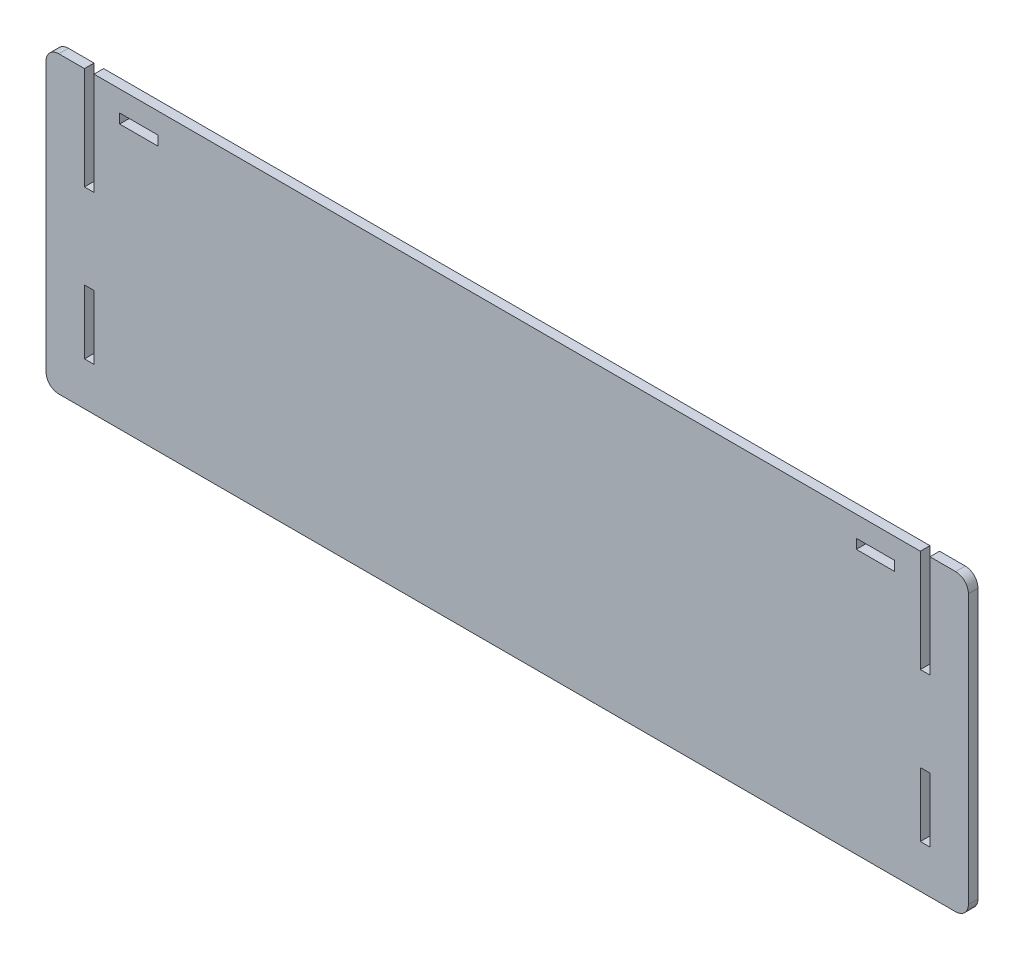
ISO-10303-21;
HEADER;
FILE_DESCRIPTION(('STEP AP214'),'2;1');
FILE_NAME('part.step','',(''),(''),'','','');
FILE_SCHEMA(('AUTOMOTIVE_DESIGN { 1 0 10303 214 1 1 1 1 }'));
ENDSEC;
DATA;
#1=APPLICATION_CONTEXT('core data for automotive mechanical design processes');
#2=APPLICATION_PROTOCOL_DEFINITION('international standard','automotive_design',2000,#1);
#3=PRODUCT_CONTEXT('',#1,'mechanical');
#4=PRODUCT('Part','Part','',(#3));
#5=PRODUCT_RELATED_PRODUCT_CATEGORY('part','',(#4));
#6=PRODUCT_DEFINITION_FORMATION('','',#4);
#7=PRODUCT_DEFINITION_CONTEXT('part definition',#1,'design');
#8=PRODUCT_DEFINITION('design','',#6,#7);
#9=PRODUCT_DEFINITION_SHAPE('','',#8);
#10=(LENGTH_UNIT() NAMED_UNIT(*) SI_UNIT(.MILLI.,.METRE.));
#11=(NAMED_UNIT(*) PLANE_ANGLE_UNIT() SI_UNIT($,.RADIAN.));
#12=(NAMED_UNIT(*) SI_UNIT($,.STERADIAN.) SOLID_ANGLE_UNIT());
#13=UNCERTAINTY_MEASURE_WITH_UNIT(LENGTH_MEASURE(1.E-05),#10,'distance_accuracy_value','');
#14=(GEOMETRIC_REPRESENTATION_CONTEXT(3) GLOBAL_UNCERTAINTY_ASSIGNED_CONTEXT((#13)) GLOBAL_UNIT_ASSIGNED_CONTEXT((#10,
#11,#12)) REPRESENTATION_CONTEXT('',''));
#15=CARTESIAN_POINT('',(0.,0.,0.));
#16=DIRECTION('',(0.,0.,1.));
#17=DIRECTION('',(1.,0.,0.));
#18=AXIS2_PLACEMENT_3D('',#15,#16,#17);
#19=CARTESIAN_POINT('',(0.,0.,19.05));
#20=DIRECTION('',(0.,0.,1.));
#21=DIRECTION('',(1.,0.,0.));
#22=AXIS2_PLACEMENT_3D('',#19,#20,#21);
#23=PLANE('',#22);
#24=DIRECTION('',(1.,0.,0.));
#25=VECTOR('',#24,1.);
#26=CARTESIAN_POINT('',(-838.2,-206.375,19.05));
#27=LINE('',#26,#25);
#28=CARTESIAN_POINT('',(-838.2,-206.375,19.05));
#29=VERTEX_POINT('',#28);
#30=CARTESIAN_POINT('',(-819.15,-206.375,19.05));
#31=VERTEX_POINT('',#30);
#32=EDGE_CURVE('E316',#29,#31,#27,.T.);
#33=ORIENTED_EDGE('',*,*,#32,.F.);
#34=DIRECTION('',(0.,-1.,0.));
#35=VECTOR('',#34,1.);
#36=CARTESIAN_POINT('',(-838.2,-79.3749999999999,19.05));
#37=LINE('',#36,#35);
#38=CARTESIAN_POINT('',(-838.2,-79.3749999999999,19.05));
#39=VERTEX_POINT('',#38);
#40=EDGE_CURVE('E308',#39,#29,#37,.T.);
#41=ORIENTED_EDGE('',*,*,#40,.F.);
#42=DIRECTION('',(-1.,0.,0.));
#43=VECTOR('',#42,1.);
#44=CARTESIAN_POINT('',(-838.2,-79.3749999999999,19.05));
#45=LINE('',#44,#43);
#46=CARTESIAN_POINT('',(-819.15,-79.3749999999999,19.05));
#47=VERTEX_POINT('',#46);
#48=EDGE_CURVE('E310',#47,#39,#45,.T.);
#49=ORIENTED_EDGE('',*,*,#48,.F.);
#50=DIRECTION('',(0.,1.,0.));
#51=VECTOR('',#50,1.);
#52=CARTESIAN_POINT('',(-819.15,-79.3749999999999,19.05));
#53=LINE('',#52,#51);
#54=EDGE_CURVE('E313',#31,#47,#53,.T.);
#55=ORIENTED_EDGE('',*,*,#54,.F.);
#56=EDGE_LOOP('',(#33,#41,#49,#55));
#57=FACE_BOUND('',#56,.T.);
#58=DIRECTION('',(0.,-1.,0.));
#59=VECTOR('',#58,1.);
#60=CARTESIAN_POINT('',(838.2,-79.3749999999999,19.05));
#61=LINE('',#60,#59);
#62=CARTESIAN_POINT('',(838.2,-79.3749999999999,19.05));
#63=VERTEX_POINT('',#62);
#64=CARTESIAN_POINT('',(838.2,-206.375,19.05));
#65=VERTEX_POINT('',#64);
#66=EDGE_CURVE('E339',#63,#65,#61,.T.);
#67=ORIENTED_EDGE('',*,*,#66,.T.);
#68=DIRECTION('',(-1.,0.,0.));
#69=VECTOR('',#68,1.);
#70=CARTESIAN_POINT('',(838.2,-206.375,19.05));
#71=LINE('',#70,#69);
#72=CARTESIAN_POINT('',(819.15,-206.375,19.05));
#73=VERTEX_POINT('',#72);
#74=EDGE_CURVE('E342',#65,#73,#71,.T.);
#75=ORIENTED_EDGE('',*,*,#74,.T.);
#76=DIRECTION('',(0.,1.,0.));
#77=VECTOR('',#76,1.);
#78=CARTESIAN_POINT('',(819.15,-79.3749999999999,19.05));
#79=LINE('',#78,#77);
#80=CARTESIAN_POINT('',(819.15,-79.3749999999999,19.05));
#81=VERTEX_POINT('',#80);
#82=EDGE_CURVE('E346',#73,#81,#79,.T.);
#83=ORIENTED_EDGE('',*,*,#82,.T.);
#84=DIRECTION('',(1.,0.,0.));
#85=VECTOR('',#84,1.);
#86=CARTESIAN_POINT('',(838.2,-79.3749999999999,19.05));
#87=LINE('',#86,#85);
#88=EDGE_CURVE('E349',#81,#63,#87,.T.);
#89=ORIENTED_EDGE('',*,*,#88,.T.);
#90=EDGE_LOOP('',(#67,#75,#83,#89));
#91=FACE_BOUND('',#90,.T.);
#92=DIRECTION('',(1.,0.,0.));
#93=VECTOR('',#92,1.);
#94=CARTESIAN_POINT('',(-838.2,88.9,19.05));
#95=LINE('',#94,#93);
#96=CARTESIAN_POINT('',(-838.2,88.9,19.05));
#97=VERTEX_POINT('',#96);
#98=CARTESIAN_POINT('',(-819.15,88.9,19.05));
#99=VERTEX_POINT('',#98);
#100=EDGE_CURVE('E376',#97,#99,#95,.T.);
#101=ORIENTED_EDGE('',*,*,#100,.F.);
#102=DIRECTION('',(0.,-1.,0.));
#103=VECTOR('',#102,1.);
#104=CARTESIAN_POINT('',(-838.2,292.1,19.05));
#105=LINE('',#104,#103);
#106=CARTESIAN_POINT('',(-838.2,292.1,19.05));
#107=VERTEX_POINT('',#106);
#108=EDGE_CURVE('E371',#107,#97,#105,.T.);
#109=ORIENTED_EDGE('',*,*,#108,.F.);
#110=DIRECTION('',(-1.,0.,0.));
#111=VECTOR('',#110,1.);
#112=CARTESIAN_POINT('',(-914.4,292.1,19.05));
#113=LINE('',#112,#111);
#114=CARTESIAN_POINT('',(-889.,292.1,19.05));
#115=VERTEX_POINT('',#114);
#116=EDGE_CURVE('E426',#107,#115,#113,.T.);
#117=ORIENTED_EDGE('',*,*,#116,.T.);
#118=CARTESIAN_POINT('',(-889.,266.7,19.05));
#119=DIRECTION('',(0.,0.,1.));
#120=DIRECTION('',(1.,0.,0.));
#121=AXIS2_PLACEMENT_3D('',#118,#119,#120);
#122=CIRCLE('',#121,25.4);
#123=CARTESIAN_POINT('',(-914.4,266.7,19.05));
#124=VERTEX_POINT('',#123);
#125=EDGE_CURVE('E471',#115,#124,#122,.T.);
#126=ORIENTED_EDGE('',*,*,#125,.T.);
#127=DIRECTION('',(0.,-1.,0.));
#128=VECTOR('',#127,1.);
#129=CARTESIAN_POINT('',(-914.4,292.1,19.05));
#130=LINE('',#129,#128);
#131=CARTESIAN_POINT('',(-914.4,-266.7,19.05));
#132=VERTEX_POINT('',#131);
#133=EDGE_CURVE('E430',#124,#132,#130,.T.);
#134=ORIENTED_EDGE('',*,*,#133,.T.);
#135=CARTESIAN_POINT('',(-889.,-266.7,19.05));
#136=DIRECTION('',(0.,0.,1.));
#137=DIRECTION('',(1.,0.,0.));
#138=AXIS2_PLACEMENT_3D('',#135,#136,#137);
#139=CIRCLE('',#138,25.4);
#140=CARTESIAN_POINT('',(-889.,-292.1,19.05));
#141=VERTEX_POINT('',#140);
#142=EDGE_CURVE('E469',#132,#141,#139,.T.);
#143=ORIENTED_EDGE('',*,*,#142,.T.);
#144=DIRECTION('',(1.,0.,0.));
#145=VECTOR('',#144,1.);
#146=CARTESIAN_POINT('',(-914.4,-292.1,19.05));
#147=LINE('',#146,#145);
#148=CARTESIAN_POINT('',(889.,-292.1,19.05));
#149=VERTEX_POINT('',#148);
#150=EDGE_CURVE('E434',#141,#149,#147,.T.);
#151=ORIENTED_EDGE('',*,*,#150,.T.);
#152=CARTESIAN_POINT('',(889.,-266.7,19.05));
#153=DIRECTION('',(0.,0.,1.));
#154=DIRECTION('',(1.,0.,0.));
#155=AXIS2_PLACEMENT_3D('',#152,#153,#154);
#156=CIRCLE('',#155,25.4);
#157=CARTESIAN_POINT('',(914.4,-266.7,19.05));
#158=VERTEX_POINT('',#157);
#159=EDGE_CURVE('E467',#149,#158,#156,.T.);
#160=ORIENTED_EDGE('',*,*,#159,.T.);
#161=DIRECTION('',(0.,1.,0.));
#162=VECTOR('',#161,1.);
#163=CARTESIAN_POINT('',(914.4,292.1,19.05));
#164=LINE('',#163,#162);
#165=CARTESIAN_POINT('',(914.4,266.7,19.05));
#166=VERTEX_POINT('',#165);
#167=EDGE_CURVE('E423',#158,#166,#164,.T.);
#168=ORIENTED_EDGE('',*,*,#167,.T.);
#169=CARTESIAN_POINT('',(889.,266.7,19.05));
#170=DIRECTION('',(0.,0.,1.));
#171=DIRECTION('',(1.,0.,0.));
#172=AXIS2_PLACEMENT_3D('',#169,#170,#171);
#173=CIRCLE('',#172,25.4);
#174=CARTESIAN_POINT('',(889.,292.1,19.05));
#175=VERTEX_POINT('',#174);
#176=EDGE_CURVE('E465',#166,#175,#173,.T.);
#177=ORIENTED_EDGE('',*,*,#176,.T.);
#178=CARTESIAN_POINT('',(838.2,292.1,19.05));
#179=VERTEX_POINT('',#178);
#180=EDGE_CURVE('E428',#175,#179,#113,.T.);
#181=ORIENTED_EDGE('',*,*,#180,.T.);
#182=DIRECTION('',(0.,-1.,0.));
#183=VECTOR('',#182,1.);
#184=CARTESIAN_POINT('',(838.2,292.1,19.05));
#185=LINE('',#184,#183);
#186=CARTESIAN_POINT('',(838.2,88.9,19.05));
#187=VERTEX_POINT('',#186);
#188=EDGE_CURVE('E396',#179,#187,#185,.T.);
#189=ORIENTED_EDGE('',*,*,#188,.T.);
#190=DIRECTION('',(-1.,0.,0.));
#191=VECTOR('',#190,1.);
#192=CARTESIAN_POINT('',(838.2,88.9,19.05));
#193=LINE('',#192,#191);
#194=CARTESIAN_POINT('',(819.15,88.9,19.05));
#195=VERTEX_POINT('',#194);
#196=EDGE_CURVE('E399',#187,#195,#193,.T.);
#197=ORIENTED_EDGE('',*,*,#196,.T.);
#198=DIRECTION('',(0.,1.,0.));
#199=VECTOR('',#198,1.);
#200=CARTESIAN_POINT('',(819.15,292.1,19.05));
#201=LINE('',#200,#199);
#202=CARTESIAN_POINT('',(819.15,292.1,19.05));
#203=VERTEX_POINT('',#202);
#204=EDGE_CURVE('E403',#195,#203,#201,.T.);
#205=ORIENTED_EDGE('',*,*,#204,.T.);
#206=CARTESIAN_POINT('',(-819.15,292.1,19.05));
#207=VERTEX_POINT('',#206);
#208=EDGE_CURVE('E431',#203,#207,#113,.T.);
#209=ORIENTED_EDGE('',*,*,#208,.T.);
#210=DIRECTION('',(0.,1.,0.));
#211=VECTOR('',#210,1.);
#212=CARTESIAN_POINT('',(-819.15,292.1,19.05));
#213=LINE('',#212,#211);
#214=EDGE_CURVE('E373',#99,#207,#213,.T.);
#215=ORIENTED_EDGE('',*,*,#214,.F.);
#216=EDGE_LOOP('',(#101,#109,#117,#126,#134,#143,#151,#160,#168,#177,#181,#189,#197,#205,#209,#215));
#217=FACE_BOUND('',#216,.T.);
#218=DIRECTION('',(0.,-1.,0.));
#219=VECTOR('',#218,1.);
#220=CARTESIAN_POINT('',(768.35,250.825,19.05));
#221=LINE('',#220,#219);
#222=CARTESIAN_POINT('',(768.35,250.825,19.05));
#223=VERTEX_POINT('',#222);
#224=CARTESIAN_POINT('',(768.35,231.775,19.05));
#225=VERTEX_POINT('',#224);
#226=EDGE_CURVE('E276',#223,#225,#221,.T.);
#227=ORIENTED_EDGE('',*,*,#226,.T.);
#228=DIRECTION('',(-1.,0.,0.));
#229=VECTOR('',#228,1.);
#230=CARTESIAN_POINT('',(768.35,231.775,19.05));
#231=LINE('',#230,#229);
#232=CARTESIAN_POINT('',(692.15,231.775,19.05));
#233=VERTEX_POINT('',#232);
#234=EDGE_CURVE('E279',#225,#233,#231,.T.);
#235=ORIENTED_EDGE('',*,*,#234,.T.);
#236=DIRECTION('',(0.,1.,0.));
#237=VECTOR('',#236,1.);
#238=CARTESIAN_POINT('',(692.15,250.825,19.05));
#239=LINE('',#238,#237);
#240=CARTESIAN_POINT('',(692.15,250.825,19.05));
#241=VERTEX_POINT('',#240);
#242=EDGE_CURVE('E283',#233,#241,#239,.T.);
#243=ORIENTED_EDGE('',*,*,#242,.T.);
#244=DIRECTION('',(1.,0.,0.));
#245=VECTOR('',#244,1.);
#246=CARTESIAN_POINT('',(768.35,250.825,19.05));
#247=LINE('',#246,#245);
#248=EDGE_CURVE('E286',#241,#223,#247,.T.);
#249=ORIENTED_EDGE('',*,*,#248,.T.);
#250=EDGE_LOOP('',(#227,#235,#243,#249));
#251=FACE_BOUND('',#250,.T.);
#252=DIRECTION('',(1.,0.,0.));
#253=VECTOR('',#252,1.);
#254=CARTESIAN_POINT('',(-768.35,231.775,19.05));
#255=LINE('',#254,#253);
#256=CARTESIAN_POINT('',(-768.35,231.775,19.05));
#257=VERTEX_POINT('',#256);
#258=CARTESIAN_POINT('',(-692.15,231.775,19.05));
#259=VERTEX_POINT('',#258);
#260=EDGE_CURVE('E254',#257,#259,#255,.T.);
#261=ORIENTED_EDGE('',*,*,#260,.F.);
#262=DIRECTION('',(0.,-1.,0.));
#263=VECTOR('',#262,1.);
#264=CARTESIAN_POINT('',(-768.35,250.825,19.05));
#265=LINE('',#264,#263);
#266=CARTESIAN_POINT('',(-768.35,250.825,19.05));
#267=VERTEX_POINT('',#266);
#268=EDGE_CURVE('E250',#267,#257,#265,.T.);
#269=ORIENTED_EDGE('',*,*,#268,.F.);
#270=DIRECTION('',(-1.,0.,0.));
#271=VECTOR('',#270,1.);
#272=CARTESIAN_POINT('',(-768.35,250.825,19.05));
#273=LINE('',#272,#271);
#274=CARTESIAN_POINT('',(-692.15,250.825,19.05));
#275=VERTEX_POINT('',#274);
#276=EDGE_CURVE('E242',#275,#267,#273,.T.);
#277=ORIENTED_EDGE('',*,*,#276,.F.);
#278=DIRECTION('',(0.,1.,0.));
#279=VECTOR('',#278,1.);
#280=CARTESIAN_POINT('',(-692.15,250.825,19.05));
#281=LINE('',#280,#279);
#282=EDGE_CURVE('E249',#259,#275,#281,.T.);
#283=ORIENTED_EDGE('',*,*,#282,.F.);
#284=EDGE_LOOP('',(#261,#269,#277,#283));
#285=FACE_BOUND('',#284,.T.);
#286=ADVANCED_FACE('F33',(#57,#91,#217,#251,#285),#23,.T.);
#287=CARTESIAN_POINT('',(0.,0.,0.));
#288=DIRECTION('',(0.,0.,1.));
#289=DIRECTION('',(1.,0.,0.));
#290=AXIS2_PLACEMENT_3D('',#287,#288,#289);
#291=PLANE('',#290);
#292=DIRECTION('',(0.,-1.,0.));
#293=VECTOR('',#292,1.);
#294=CARTESIAN_POINT('',(-838.2,-79.3749999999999,0.));
#295=LINE('',#294,#293);
#296=CARTESIAN_POINT('',(-838.2,-79.3749999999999,0.));
#297=VERTEX_POINT('',#296);
#298=CARTESIAN_POINT('',(-838.2,-206.375,0.));
#299=VERTEX_POINT('',#298);
#300=EDGE_CURVE('E301',#297,#299,#295,.T.);
#301=ORIENTED_EDGE('',*,*,#300,.T.);
#302=DIRECTION('',(1.,0.,0.));
#303=VECTOR('',#302,1.);
#304=CARTESIAN_POINT('',(-838.2,-206.375,0.));
#305=LINE('',#304,#303);
#306=CARTESIAN_POINT('',(-819.15,-206.375,0.));
#307=VERTEX_POINT('',#306);
#308=EDGE_CURVE('E311',#299,#307,#305,.T.);
#309=ORIENTED_EDGE('',*,*,#308,.T.);
#310=DIRECTION('',(0.,1.,0.));
#311=VECTOR('',#310,1.);
#312=CARTESIAN_POINT('',(-819.15,-79.3749999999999,0.));
#313=LINE('',#312,#311);
#314=CARTESIAN_POINT('',(-819.15,-79.3749999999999,0.));
#315=VERTEX_POINT('',#314);
#316=EDGE_CURVE('E324',#307,#315,#313,.T.);
#317=ORIENTED_EDGE('',*,*,#316,.T.);
#318=DIRECTION('',(-1.,0.,0.));
#319=VECTOR('',#318,1.);
#320=CARTESIAN_POINT('',(-838.2,-79.3749999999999,0.));
#321=LINE('',#320,#319);
#322=EDGE_CURVE('E321',#315,#297,#321,.T.);
#323=ORIENTED_EDGE('',*,*,#322,.T.);
#324=EDGE_LOOP('',(#301,#309,#317,#323));
#325=FACE_BOUND('',#324,.T.);
#326=DIRECTION('',(-1.,0.,0.));
#327=VECTOR('',#326,1.);
#328=CARTESIAN_POINT('',(838.2,-206.375,0.));
#329=LINE('',#328,#327);
#330=CARTESIAN_POINT('',(838.2,-206.375,0.));
#331=VERTEX_POINT('',#330);
#332=CARTESIAN_POINT('',(819.15,-206.375,0.));
#333=VERTEX_POINT('',#332);
#334=EDGE_CURVE('E354',#331,#333,#329,.T.);
#335=ORIENTED_EDGE('',*,*,#334,.F.);
#336=DIRECTION('',(0.,-1.,0.));
#337=VECTOR('',#336,1.);
#338=CARTESIAN_POINT('',(838.2,-79.3749999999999,0.));
#339=LINE('',#338,#337);
#340=CARTESIAN_POINT('',(838.2,-79.3749999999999,0.));
#341=VERTEX_POINT('',#340);
#342=EDGE_CURVE('E332',#341,#331,#339,.T.);
#343=ORIENTED_EDGE('',*,*,#342,.F.);
#344=DIRECTION('',(1.,0.,0.));
#345=VECTOR('',#344,1.);
#346=CARTESIAN_POINT('',(838.2,-79.3749999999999,0.));
#347=LINE('',#346,#345);
#348=CARTESIAN_POINT('',(819.15,-79.3749999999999,0.));
#349=VERTEX_POINT('',#348);
#350=EDGE_CURVE('E343',#349,#341,#347,.T.);
#351=ORIENTED_EDGE('',*,*,#350,.F.);
#352=DIRECTION('',(0.,1.,0.));
#353=VECTOR('',#352,1.);
#354=CARTESIAN_POINT('',(819.15,-79.3749999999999,0.));
#355=LINE('',#354,#353);
#356=EDGE_CURVE('E357',#333,#349,#355,.T.);
#357=ORIENTED_EDGE('',*,*,#356,.F.);
#358=EDGE_LOOP('',(#335,#343,#351,#357));
#359=FACE_BOUND('',#358,.T.);
#360=DIRECTION('',(0.,-1.,0.));
#361=VECTOR('',#360,1.);
#362=CARTESIAN_POINT('',(-838.2,292.1,0.));
#363=LINE('',#362,#361);
#364=CARTESIAN_POINT('',(-838.2,292.1,0.));
#365=VERTEX_POINT('',#364);
#366=CARTESIAN_POINT('',(-838.2,88.9,0.));
#367=VERTEX_POINT('',#366);
#368=EDGE_CURVE('E364',#365,#367,#363,.T.);
#369=ORIENTED_EDGE('',*,*,#368,.T.);
#370=DIRECTION('',(1.,0.,0.));
#371=VECTOR('',#370,1.);
#372=CARTESIAN_POINT('',(-838.2,88.9,0.));
#373=LINE('',#372,#371);
#374=CARTESIAN_POINT('',(-819.15,88.9,0.));
#375=VERTEX_POINT('',#374);
#376=EDGE_CURVE('E374',#367,#375,#373,.T.);
#377=ORIENTED_EDGE('',*,*,#376,.T.);
#378=DIRECTION('',(0.,1.,0.));
#379=VECTOR('',#378,1.);
#380=CARTESIAN_POINT('',(-819.15,292.1,0.));
#381=LINE('',#380,#379);
#382=CARTESIAN_POINT('',(-819.15,292.1,0.));
#383=VERTEX_POINT('',#382);
#384=EDGE_CURVE('E381',#375,#383,#381,.T.);
#385=ORIENTED_EDGE('',*,*,#384,.T.);
#386=DIRECTION('',(-1.,0.,0.));
#387=VECTOR('',#386,1.);
#388=CARTESIAN_POINT('',(-914.4,292.1,0.));
#389=LINE('',#388,#387);
#390=CARTESIAN_POINT('',(819.15,292.1,0.));
#391=VERTEX_POINT('',#390);
#392=EDGE_CURVE('E444',#391,#383,#389,.T.);
#393=ORIENTED_EDGE('',*,*,#392,.F.);
#394=DIRECTION('',(0.,1.,0.));
#395=VECTOR('',#394,1.);
#396=CARTESIAN_POINT('',(819.15,292.1,0.));
#397=LINE('',#396,#395);
#398=CARTESIAN_POINT('',(819.15,88.9,0.));
#399=VERTEX_POINT('',#398);
#400=EDGE_CURVE('E400',#399,#391,#397,.T.);
#401=ORIENTED_EDGE('',*,*,#400,.F.);
#402=DIRECTION('',(-1.,0.,0.));
#403=VECTOR('',#402,1.);
#404=CARTESIAN_POINT('',(838.2,88.9,0.));
#405=LINE('',#404,#403);
#406=CARTESIAN_POINT('',(838.2,88.9,0.));
#407=VERTEX_POINT('',#406);
#408=EDGE_CURVE('E408',#407,#399,#405,.T.);
#409=ORIENTED_EDGE('',*,*,#408,.F.);
#410=DIRECTION('',(0.,-1.,0.));
#411=VECTOR('',#410,1.);
#412=CARTESIAN_POINT('',(838.2,292.1,0.));
#413=LINE('',#412,#411);
#414=CARTESIAN_POINT('',(838.2,292.1,0.));
#415=VERTEX_POINT('',#414);
#416=EDGE_CURVE('E389',#415,#407,#413,.T.);
#417=ORIENTED_EDGE('',*,*,#416,.F.);
#418=CARTESIAN_POINT('',(889.,292.1,0.));
#419=VERTEX_POINT('',#418);
#420=EDGE_CURVE('E441',#419,#415,#389,.T.);
#421=ORIENTED_EDGE('',*,*,#420,.F.);
#422=CARTESIAN_POINT('',(889.,266.7,0.));
#423=DIRECTION('',(0.,0.,1.));
#424=DIRECTION('',(1.,0.,0.));
#425=AXIS2_PLACEMENT_3D('',#422,#423,#424);
#426=CIRCLE('',#425,25.4);
#427=CARTESIAN_POINT('',(914.4,266.7,0.));
#428=VERTEX_POINT('',#427);
#429=EDGE_CURVE('E453',#419,#428,#426,.F.);
#430=ORIENTED_EDGE('',*,*,#429,.T.);
#431=DIRECTION('',(0.,1.,0.));
#432=VECTOR('',#431,1.);
#433=CARTESIAN_POINT('',(914.4,292.1,0.));
#434=LINE('',#433,#432);
#435=CARTESIAN_POINT('',(914.4,-266.7,0.));
#436=VERTEX_POINT('',#435);
#437=EDGE_CURVE('E415',#436,#428,#434,.T.);
#438=ORIENTED_EDGE('',*,*,#437,.F.);
#439=CARTESIAN_POINT('',(889.,-266.7,0.));
#440=DIRECTION('',(0.,0.,1.));
#441=DIRECTION('',(1.,0.,0.));
#442=AXIS2_PLACEMENT_3D('',#439,#440,#441);
#443=CIRCLE('',#442,25.4);
#444=CARTESIAN_POINT('',(889.,-292.1,0.));
#445=VERTEX_POINT('',#444);
#446=EDGE_CURVE('E455',#436,#445,#443,.F.);
#447=ORIENTED_EDGE('',*,*,#446,.T.);
#448=DIRECTION('',(1.,0.,0.));
#449=VECTOR('',#448,1.);
#450=CARTESIAN_POINT('',(-914.4,-292.1,0.));
#451=LINE('',#450,#449);
#452=CARTESIAN_POINT('',(-889.,-292.1,0.));
#453=VERTEX_POINT('',#452);
#454=EDGE_CURVE('E427',#453,#445,#451,.T.);
#455=ORIENTED_EDGE('',*,*,#454,.F.);
#456=CARTESIAN_POINT('',(-889.,-266.7,0.));
#457=DIRECTION('',(0.,0.,1.));
#458=DIRECTION('',(1.,0.,0.));
#459=AXIS2_PLACEMENT_3D('',#456,#457,#458);
#460=CIRCLE('',#459,25.4);
#461=CARTESIAN_POINT('',(-914.4,-266.7,0.));
#462=VERTEX_POINT('',#461);
#463=EDGE_CURVE('E457',#453,#462,#460,.F.);
#464=ORIENTED_EDGE('',*,*,#463,.T.);
#465=DIRECTION('',(0.,-1.,0.));
#466=VECTOR('',#465,1.);
#467=CARTESIAN_POINT('',(-914.4,292.1,0.));
#468=LINE('',#467,#466);
#469=CARTESIAN_POINT('',(-914.4,266.7,0.));
#470=VERTEX_POINT('',#469);
#471=EDGE_CURVE('E443',#470,#462,#468,.T.);
#472=ORIENTED_EDGE('',*,*,#471,.F.);
#473=CARTESIAN_POINT('',(-889.,266.7,0.));
#474=DIRECTION('',(0.,0.,1.));
#475=DIRECTION('',(1.,0.,0.));
#476=AXIS2_PLACEMENT_3D('',#473,#474,#475);
#477=CIRCLE('',#476,25.4);
#478=CARTESIAN_POINT('',(-889.,292.1,0.));
#479=VERTEX_POINT('',#478);
#480=EDGE_CURVE('E459',#470,#479,#477,.F.);
#481=ORIENTED_EDGE('',*,*,#480,.T.);
#482=EDGE_CURVE('E440',#365,#479,#389,.T.);
#483=ORIENTED_EDGE('',*,*,#482,.F.);
#484=EDGE_LOOP('',(#369,#377,#385,#393,#401,#409,#417,#421,#430,#438,#447,#455,#464,#472,#481,#483));
#485=FACE_BOUND('',#484,.T.);
#486=DIRECTION('',(-1.,0.,0.));
#487=VECTOR('',#486,1.);
#488=CARTESIAN_POINT('',(768.35,231.775,0.));
#489=LINE('',#488,#487);
#490=CARTESIAN_POINT('',(768.35,231.775,0.));
#491=VERTEX_POINT('',#490);
#492=CARTESIAN_POINT('',(692.15,231.775,0.));
#493=VERTEX_POINT('',#492);
#494=EDGE_CURVE('E291',#491,#493,#489,.T.);
#495=ORIENTED_EDGE('',*,*,#494,.F.);
#496=DIRECTION('',(0.,-1.,0.));
#497=VECTOR('',#496,1.);
#498=CARTESIAN_POINT('',(768.35,250.825,0.));
#499=LINE('',#498,#497);
#500=CARTESIAN_POINT('',(768.35,250.825,0.));
#501=VERTEX_POINT('',#500);
#502=EDGE_CURVE('E272',#501,#491,#499,.T.);
#503=ORIENTED_EDGE('',*,*,#502,.F.);
#504=DIRECTION('',(1.,0.,0.));
#505=VECTOR('',#504,1.);
#506=CARTESIAN_POINT('',(768.35,250.825,0.));
#507=LINE('',#506,#505);
#508=CARTESIAN_POINT('',(692.15,250.825,0.));
#509=VERTEX_POINT('',#508);
#510=EDGE_CURVE('E280',#509,#501,#507,.T.);
#511=ORIENTED_EDGE('',*,*,#510,.F.);
#512=DIRECTION('',(0.,1.,0.));
#513=VECTOR('',#512,1.);
#514=CARTESIAN_POINT('',(692.15,250.825,0.));
#515=LINE('',#514,#513);
#516=EDGE_CURVE('E294',#493,#509,#515,.T.);
#517=ORIENTED_EDGE('',*,*,#516,.F.);
#518=EDGE_LOOP('',(#495,#503,#511,#517));
#519=FACE_BOUND('',#518,.T.);
#520=DIRECTION('',(0.,-1.,0.));
#521=VECTOR('',#520,1.);
#522=CARTESIAN_POINT('',(-768.35,250.825,0.));
#523=LINE('',#522,#521);
#524=CARTESIAN_POINT('',(-768.35,250.825,0.));
#525=VERTEX_POINT('',#524);
#526=CARTESIAN_POINT('',(-768.35,231.775,0.));
#527=VERTEX_POINT('',#526);
#528=EDGE_CURVE('E56',#525,#527,#523,.T.);
#529=ORIENTED_EDGE('',*,*,#528,.T.);
#530=DIRECTION('',(1.,0.,0.));
#531=VECTOR('',#530,1.);
#532=CARTESIAN_POINT('',(-768.35,231.775,0.));
#533=LINE('',#532,#531);
#534=CARTESIAN_POINT('',(-692.15,231.775,0.));
#535=VERTEX_POINT('',#534);
#536=EDGE_CURVE('E257',#527,#535,#533,.T.);
#537=ORIENTED_EDGE('',*,*,#536,.T.);
#538=DIRECTION('',(0.,1.,0.));
#539=VECTOR('',#538,1.);
#540=CARTESIAN_POINT('',(-692.15,250.825,0.));
#541=LINE('',#540,#539);
#542=CARTESIAN_POINT('',(-692.15,250.825,0.));
#543=VERTEX_POINT('',#542);
#544=EDGE_CURVE('E260',#535,#543,#541,.T.);
#545=ORIENTED_EDGE('',*,*,#544,.T.);
#546=DIRECTION('',(-1.,0.,0.));
#547=VECTOR('',#546,1.);
#548=CARTESIAN_POINT('',(-768.35,250.825,0.));
#549=LINE('',#548,#547);
#550=EDGE_CURVE('E266',#543,#525,#549,.T.);
#551=ORIENTED_EDGE('',*,*,#550,.T.);
#552=EDGE_LOOP('',(#529,#537,#545,#551));
#553=FACE_BOUND('',#552,.T.);
#554=ADVANCED_FACE('F489',(#325,#359,#485,#519,#553),#291,.F.);
#555=CARTESIAN_POINT('',(-914.4,292.1,19.05));
#556=DIRECTION('',(0.,-1.,0.));
#557=DIRECTION('',(0.,0.,-1.));
#558=AXIS2_PLACEMENT_3D('',#555,#556,#557);
#559=PLANE('',#558);
#560=DIRECTION('',(0.,0.,-1.));
#561=VECTOR('',#560,1.);
#562=CARTESIAN_POINT('',(-838.2,292.1,19.05));
#563=LINE('',#562,#561);
#564=EDGE_CURVE('E378',#107,#365,#563,.T.);
#565=ORIENTED_EDGE('',*,*,#564,.T.);
#566=ORIENTED_EDGE('',*,*,#482,.T.);
#567=DIRECTION('',(0.,0.,-1.));
#568=VECTOR('',#567,1.);
#569=CARTESIAN_POINT('',(-889.,292.1,19.05));
#570=LINE('',#569,#568);
#571=EDGE_CURVE('E462',#479,#115,#570,.F.);
#572=ORIENTED_EDGE('',*,*,#571,.T.);
#573=ORIENTED_EDGE('',*,*,#116,.F.);
#574=EDGE_LOOP('',(#565,#566,#572,#573));
#575=FACE_BOUND('',#574,.T.);
#576=ADVANCED_FACE('F527',(#575),#559,.F.);
#577=DIRECTION('',(0.,0.,-1.));
#578=VECTOR('',#577,1.);
#579=CARTESIAN_POINT('',(-819.15,292.1,19.05));
#580=LINE('',#579,#578);
#581=EDGE_CURVE('E392',#207,#383,#580,.T.);
#582=ORIENTED_EDGE('',*,*,#581,.F.);
#583=ORIENTED_EDGE('',*,*,#208,.F.);
#584=DIRECTION('',(0.,0.,-1.));
#585=VECTOR('',#584,1.);
#586=CARTESIAN_POINT('',(819.15,292.1,19.05));
#587=LINE('',#586,#585);
#588=EDGE_CURVE('E416',#203,#391,#587,.T.);
#589=ORIENTED_EDGE('',*,*,#588,.T.);
#590=ORIENTED_EDGE('',*,*,#392,.T.);
#591=EDGE_LOOP('',(#582,#583,#589,#590));
#592=FACE_BOUND('',#591,.T.);
#593=ADVANCED_FACE('F518',(#592),#559,.F.);
#594=ORIENTED_EDGE('',*,*,#180,.F.);
#595=DIRECTION('',(0.,0.,-1.));
#596=VECTOR('',#595,1.);
#597=CARTESIAN_POINT('',(889.,292.1,19.05));
#598=LINE('',#597,#596);
#599=EDGE_CURVE('E11',#175,#419,#598,.T.);
#600=ORIENTED_EDGE('',*,*,#599,.T.);
#601=ORIENTED_EDGE('',*,*,#420,.T.);
#602=DIRECTION('',(0.,0.,-1.));
#603=VECTOR('',#602,1.);
#604=CARTESIAN_POINT('',(838.2,292.1,19.05));
#605=LINE('',#604,#603);
#606=EDGE_CURVE('E412',#179,#415,#605,.T.);
#607=ORIENTED_EDGE('',*,*,#606,.F.);
#608=EDGE_LOOP('',(#594,#600,#601,#607));
#609=FACE_BOUND('',#608,.T.);
#610=ADVANCED_FACE('F499',(#609),#559,.F.);
#611=CARTESIAN_POINT('',(914.4,292.1,19.05));
#612=DIRECTION('',(-1.,0.,0.));
#613=DIRECTION('',(0.,0.,1.));
#614=AXIS2_PLACEMENT_3D('',#611,#612,#613);
#615=PLANE('',#614);
#616=ORIENTED_EDGE('',*,*,#167,.F.);
#617=DIRECTION('',(0.,0.,-1.));
#618=VECTOR('',#617,1.);
#619=CARTESIAN_POINT('',(914.4,-266.7,19.05));
#620=LINE('',#619,#618);
#621=EDGE_CURVE('E41',#158,#436,#620,.T.);
#622=ORIENTED_EDGE('',*,*,#621,.T.);
#623=ORIENTED_EDGE('',*,*,#437,.T.);
#624=DIRECTION('',(0.,0.,-1.));
#625=VECTOR('',#624,1.);
#626=CARTESIAN_POINT('',(914.4,266.7,19.05));
#627=LINE('',#626,#625);
#628=EDGE_CURVE('E478',#428,#166,#627,.F.);
#629=ORIENTED_EDGE('',*,*,#628,.T.);
#630=EDGE_LOOP('',(#616,#622,#623,#629));
#631=FACE_BOUND('',#630,.T.);
#632=ADVANCED_FACE('F484',(#631),#615,.F.);
#633=CARTESIAN_POINT('',(-914.4,292.1,19.05));
#634=DIRECTION('',(1.,0.,0.));
#635=DIRECTION('',(0.,1.,0.));
#636=AXIS2_PLACEMENT_3D('',#633,#634,#635);
#637=PLANE('',#636);
#638=ORIENTED_EDGE('',*,*,#133,.F.);
#639=DIRECTION('',(0.,0.,-1.));
#640=VECTOR('',#639,1.);
#641=CARTESIAN_POINT('',(-914.4,266.7,19.05));
#642=LINE('',#641,#640);
#643=EDGE_CURVE('E450',#124,#470,#642,.T.);
#644=ORIENTED_EDGE('',*,*,#643,.T.);
#645=ORIENTED_EDGE('',*,*,#471,.T.);
#646=DIRECTION('',(0.,0.,-1.));
#647=VECTOR('',#646,1.);
#648=CARTESIAN_POINT('',(-914.4,-266.7,19.05));
#649=LINE('',#648,#647);
#650=EDGE_CURVE('E437',#462,#132,#649,.F.);
#651=ORIENTED_EDGE('',*,*,#650,.T.);
#652=EDGE_LOOP('',(#638,#644,#645,#651));
#653=FACE_BOUND('',#652,.T.);
#654=ADVANCED_FACE('F534',(#653),#637,.F.);
#655=CARTESIAN_POINT('',(-914.4,-292.1,19.05));
#656=DIRECTION('',(0.,1.,0.));
#657=DIRECTION('',(0.,0.,1.));
#658=AXIS2_PLACEMENT_3D('',#655,#656,#657);
#659=PLANE('',#658);
#660=ORIENTED_EDGE('',*,*,#150,.F.);
#661=DIRECTION('',(0.,0.,-1.));
#662=VECTOR('',#661,1.);
#663=CARTESIAN_POINT('',(-889.,-292.1,19.05));
#664=LINE('',#663,#662);
#665=EDGE_CURVE('E475',#141,#453,#664,.T.);
#666=ORIENTED_EDGE('',*,*,#665,.T.);
#667=ORIENTED_EDGE('',*,*,#454,.T.);
#668=DIRECTION('',(0.,0.,-1.));
#669=VECTOR('',#668,1.);
#670=CARTESIAN_POINT('',(889.,-292.1,19.05));
#671=LINE('',#670,#669);
#672=EDGE_CURVE('E473',#445,#149,#671,.F.);
#673=ORIENTED_EDGE('',*,*,#672,.T.);
#674=EDGE_LOOP('',(#660,#666,#667,#673));
#675=FACE_BOUND('',#674,.T.);
#676=ADVANCED_FACE('F542',(#675),#659,.F.);
#677=CARTESIAN_POINT('',(838.2,292.1,19.05));
#678=DIRECTION('',(1.,0.,0.));
#679=DIRECTION('',(0.,0.,-1.));
#680=AXIS2_PLACEMENT_3D('',#677,#678,#679);
#681=PLANE('',#680);
#682=ORIENTED_EDGE('',*,*,#416,.T.);
#683=DIRECTION('',(0.,0.,-1.));
#684=VECTOR('',#683,1.);
#685=CARTESIAN_POINT('',(838.2,88.9,19.05));
#686=LINE('',#685,#684);
#687=EDGE_CURVE('E406',#187,#407,#686,.T.);
#688=ORIENTED_EDGE('',*,*,#687,.F.);
#689=ORIENTED_EDGE('',*,*,#188,.F.);
#690=ORIENTED_EDGE('',*,*,#606,.T.);
#691=EDGE_LOOP('',(#682,#688,#689,#690));
#692=FACE_BOUND('',#691,.T.);
#693=ADVANCED_FACE('F506',(#692),#681,.F.);
#694=CARTESIAN_POINT('',(819.15,292.1,19.05));
#695=DIRECTION('',(-1.,0.,0.));
#696=DIRECTION('',(0.,-1.,0.));
#697=AXIS2_PLACEMENT_3D('',#694,#695,#696);
#698=PLANE('',#697);
#699=ORIENTED_EDGE('',*,*,#400,.T.);
#700=ORIENTED_EDGE('',*,*,#588,.F.);
#701=ORIENTED_EDGE('',*,*,#204,.F.);
#702=DIRECTION('',(0.,0.,-1.));
#703=VECTOR('',#702,1.);
#704=CARTESIAN_POINT('',(819.15,88.9,19.05));
#705=LINE('',#704,#703);
#706=EDGE_CURVE('E419',#195,#399,#705,.T.);
#707=ORIENTED_EDGE('',*,*,#706,.T.);
#708=EDGE_LOOP('',(#699,#700,#701,#707));
#709=FACE_BOUND('',#708,.T.);
#710=ADVANCED_FACE('F578',(#709),#698,.F.);
#711=CARTESIAN_POINT('',(838.2,88.9,19.05));
#712=DIRECTION('',(0.,-1.,0.));
#713=DIRECTION('',(0.,0.,-1.));
#714=AXIS2_PLACEMENT_3D('',#711,#712,#713);
#715=PLANE('',#714);
#716=ORIENTED_EDGE('',*,*,#408,.T.);
#717=ORIENTED_EDGE('',*,*,#706,.F.);
#718=ORIENTED_EDGE('',*,*,#196,.F.);
#719=ORIENTED_EDGE('',*,*,#687,.T.);
#720=EDGE_LOOP('',(#716,#717,#718,#719));
#721=FACE_BOUND('',#720,.T.);
#722=ADVANCED_FACE('F510',(#721),#715,.F.);
#723=CARTESIAN_POINT('',(-889.,266.7,19.05));
#724=DIRECTION('',(0.,0.,-1.));
#725=DIRECTION('',(-1.,0.,0.));
#726=AXIS2_PLACEMENT_3D('',#723,#724,#725);
#727=CYLINDRICAL_SURFACE('',#726,25.4);
#728=ORIENTED_EDGE('',*,*,#125,.F.);
#729=ORIENTED_EDGE('',*,*,#571,.F.);
#730=ORIENTED_EDGE('',*,*,#480,.F.);
#731=ORIENTED_EDGE('',*,*,#643,.F.);
#732=EDGE_LOOP('',(#728,#729,#730,#731));
#733=FACE_BOUND('',#732,.T.);
#734=ADVANCED_FACE('F531',(#733),#727,.T.);
#735=CARTESIAN_POINT('',(-889.,-266.7,19.05));
#736=DIRECTION('',(0.,0.,-1.));
#737=DIRECTION('',(-1.,0.,0.));
#738=AXIS2_PLACEMENT_3D('',#735,#736,#737);
#739=CYLINDRICAL_SURFACE('',#738,25.4);
#740=ORIENTED_EDGE('',*,*,#142,.F.);
#741=ORIENTED_EDGE('',*,*,#650,.F.);
#742=ORIENTED_EDGE('',*,*,#463,.F.);
#743=ORIENTED_EDGE('',*,*,#665,.F.);
#744=EDGE_LOOP('',(#740,#741,#742,#743));
#745=FACE_BOUND('',#744,.T.);
#746=ADVANCED_FACE('F539',(#745),#739,.T.);
#747=CARTESIAN_POINT('',(889.,-266.7,19.05));
#748=DIRECTION('',(0.,0.,-1.));
#749=DIRECTION('',(-1.,0.,0.));
#750=AXIS2_PLACEMENT_3D('',#747,#748,#749);
#751=CYLINDRICAL_SURFACE('',#750,25.4);
#752=ORIENTED_EDGE('',*,*,#159,.F.);
#753=ORIENTED_EDGE('',*,*,#672,.F.);
#754=ORIENTED_EDGE('',*,*,#446,.F.);
#755=ORIENTED_EDGE('',*,*,#621,.F.);
#756=EDGE_LOOP('',(#752,#753,#754,#755));
#757=FACE_BOUND('',#756,.T.);
#758=ADVANCED_FACE('F544',(#757),#751,.T.);
#759=CARTESIAN_POINT('',(889.,266.7,19.05));
#760=DIRECTION('',(0.,0.,-1.));
#761=DIRECTION('',(-1.,0.,0.));
#762=AXIS2_PLACEMENT_3D('',#759,#760,#761);
#763=CYLINDRICAL_SURFACE('',#762,25.4);
#764=ORIENTED_EDGE('',*,*,#176,.F.);
#765=ORIENTED_EDGE('',*,*,#628,.F.);
#766=ORIENTED_EDGE('',*,*,#429,.F.);
#767=ORIENTED_EDGE('',*,*,#599,.F.);
#768=EDGE_LOOP('',(#764,#765,#766,#767));
#769=FACE_BOUND('',#768,.T.);
#770=ADVANCED_FACE('F35',(#769),#763,.T.);
#771=CARTESIAN_POINT('',(-838.2,292.1,19.05));
#772=DIRECTION('',(1.,0.,0.));
#773=DIRECTION('',(0.,0.,-1.));
#774=AXIS2_PLACEMENT_3D('',#771,#772,#773);
#775=PLANE('',#774);
#776=ORIENTED_EDGE('',*,*,#368,.F.);
#777=ORIENTED_EDGE('',*,*,#564,.F.);
#778=ORIENTED_EDGE('',*,*,#108,.T.);
#779=DIRECTION('',(0.,0.,-1.));
#780=VECTOR('',#779,1.);
#781=CARTESIAN_POINT('',(-838.2,88.9,19.05));
#782=LINE('',#781,#780);
#783=EDGE_CURVE('E386',#97,#367,#782,.T.);
#784=ORIENTED_EDGE('',*,*,#783,.T.);
#785=EDGE_LOOP('',(#776,#777,#778,#784));
#786=FACE_BOUND('',#785,.T.);
#787=ADVANCED_FACE('F550',(#786),#775,.T.);
#788=CARTESIAN_POINT('',(-838.2,88.9,19.05));
#789=DIRECTION('',(0.,1.,0.));
#790=DIRECTION('',(0.,0.,1.));
#791=AXIS2_PLACEMENT_3D('',#788,#789,#790);
#792=PLANE('',#791);
#793=ORIENTED_EDGE('',*,*,#376,.F.);
#794=ORIENTED_EDGE('',*,*,#783,.F.);
#795=ORIENTED_EDGE('',*,*,#100,.T.);
#796=DIRECTION('',(0.,0.,-1.));
#797=VECTOR('',#796,1.);
#798=CARTESIAN_POINT('',(-819.15,88.9,19.05));
#799=LINE('',#798,#797);
#800=EDGE_CURVE('E390',#99,#375,#799,.T.);
#801=ORIENTED_EDGE('',*,*,#800,.T.);
#802=EDGE_LOOP('',(#793,#794,#795,#801));
#803=FACE_BOUND('',#802,.T.);
#804=ADVANCED_FACE('F586',(#803),#792,.T.);
#805=CARTESIAN_POINT('',(-819.15,292.1,19.05));
#806=DIRECTION('',(-1.,0.,0.));
#807=DIRECTION('',(0.,-1.,0.));
#808=AXIS2_PLACEMENT_3D('',#805,#806,#807);
#809=PLANE('',#808);
#810=ORIENTED_EDGE('',*,*,#384,.F.);
#811=ORIENTED_EDGE('',*,*,#800,.F.);
#812=ORIENTED_EDGE('',*,*,#214,.T.);
#813=ORIENTED_EDGE('',*,*,#581,.T.);
#814=EDGE_LOOP('',(#810,#811,#812,#813));
#815=FACE_BOUND('',#814,.T.);
#816=ADVANCED_FACE('F588',(#815),#809,.T.);
#817=CARTESIAN_POINT('',(838.2,-79.3749999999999,19.05));
#818=DIRECTION('',(1.,0.,0.));
#819=DIRECTION('',(0.,0.,-1.));
#820=AXIS2_PLACEMENT_3D('',#817,#818,#819);
#821=PLANE('',#820);
#822=ORIENTED_EDGE('',*,*,#342,.T.);
#823=DIRECTION('',(0.,0.,-1.));
#824=VECTOR('',#823,1.);
#825=CARTESIAN_POINT('',(838.2,-206.375,19.05));
#826=LINE('',#825,#824);
#827=EDGE_CURVE('E352',#65,#331,#826,.T.);
#828=ORIENTED_EDGE('',*,*,#827,.F.);
#829=ORIENTED_EDGE('',*,*,#66,.F.);
#830=DIRECTION('',(0.,0.,-1.));
#831=VECTOR('',#830,1.);
#832=CARTESIAN_POINT('',(838.2,-79.3749999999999,19.05));
#833=LINE('',#832,#831);
#834=EDGE_CURVE('E362',#63,#341,#833,.T.);
#835=ORIENTED_EDGE('',*,*,#834,.T.);
#836=EDGE_LOOP('',(#822,#828,#829,#835));
#837=FACE_BOUND('',#836,.T.);
#838=ADVANCED_FACE('F591',(#837),#821,.F.);
#839=CARTESIAN_POINT('',(838.2,-79.3749999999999,19.05));
#840=DIRECTION('',(0.,1.,0.));
#841=DIRECTION('',(0.,0.,1.));
#842=AXIS2_PLACEMENT_3D('',#839,#840,#841);
#843=PLANE('',#842);
#844=ORIENTED_EDGE('',*,*,#350,.T.);
#845=ORIENTED_EDGE('',*,*,#834,.F.);
#846=ORIENTED_EDGE('',*,*,#88,.F.);
#847=DIRECTION('',(0.,0.,-1.));
#848=VECTOR('',#847,1.);
#849=CARTESIAN_POINT('',(819.15,-79.3749999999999,19.05));
#850=LINE('',#849,#848);
#851=EDGE_CURVE('E365',#81,#349,#850,.T.);
#852=ORIENTED_EDGE('',*,*,#851,.T.);
#853=EDGE_LOOP('',(#844,#845,#846,#852));
#854=FACE_BOUND('',#853,.T.);
#855=ADVANCED_FACE('F598',(#854),#843,.F.);
#856=CARTESIAN_POINT('',(819.15,-79.3749999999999,19.05));
#857=DIRECTION('',(-1.,0.,0.));
#858=DIRECTION('',(0.,0.,1.));
#859=AXIS2_PLACEMENT_3D('',#856,#857,#858);
#860=PLANE('',#859);
#861=ORIENTED_EDGE('',*,*,#356,.T.);
#862=ORIENTED_EDGE('',*,*,#851,.F.);
#863=ORIENTED_EDGE('',*,*,#82,.F.);
#864=DIRECTION('',(0.,0.,-1.));
#865=VECTOR('',#864,1.);
#866=CARTESIAN_POINT('',(819.15,-206.375,19.05));
#867=LINE('',#866,#865);
#868=EDGE_CURVE('E367',#73,#333,#867,.T.);
#869=ORIENTED_EDGE('',*,*,#868,.T.);
#870=EDGE_LOOP('',(#861,#862,#863,#869));
#871=FACE_BOUND('',#870,.T.);
#872=ADVANCED_FACE('F604',(#871),#860,.F.);
#873=CARTESIAN_POINT('',(838.2,-206.375,19.05));
#874=DIRECTION('',(0.,-1.,0.));
#875=DIRECTION('',(0.,0.,-1.));
#876=AXIS2_PLACEMENT_3D('',#873,#874,#875);
#877=PLANE('',#876);
#878=ORIENTED_EDGE('',*,*,#334,.T.);
#879=ORIENTED_EDGE('',*,*,#868,.F.);
#880=ORIENTED_EDGE('',*,*,#74,.F.);
#881=ORIENTED_EDGE('',*,*,#827,.T.);
#882=EDGE_LOOP('',(#878,#879,#880,#881));
#883=FACE_BOUND('',#882,.T.);
#884=ADVANCED_FACE('F600',(#883),#877,.F.);
#885=CARTESIAN_POINT('',(-838.2,-79.3749999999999,19.05));
#886=DIRECTION('',(1.,0.,0.));
#887=DIRECTION('',(0.,0.,-1.));
#888=AXIS2_PLACEMENT_3D('',#885,#886,#887);
#889=PLANE('',#888);
#890=ORIENTED_EDGE('',*,*,#300,.F.);
#891=DIRECTION('',(0.,0.,-1.));
#892=VECTOR('',#891,1.);
#893=CARTESIAN_POINT('',(-838.2,-79.3749999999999,19.05));
#894=LINE('',#893,#892);
#895=EDGE_CURVE('E318',#39,#297,#894,.T.);
#896=ORIENTED_EDGE('',*,*,#895,.F.);
#897=ORIENTED_EDGE('',*,*,#40,.T.);
#898=DIRECTION('',(0.,0.,-1.));
#899=VECTOR('',#898,1.);
#900=CARTESIAN_POINT('',(-838.2,-206.375,19.05));
#901=LINE('',#900,#899);
#902=EDGE_CURVE('E329',#29,#299,#901,.T.);
#903=ORIENTED_EDGE('',*,*,#902,.T.);
#904=EDGE_LOOP('',(#890,#896,#897,#903));
#905=FACE_BOUND('',#904,.T.);
#906=ADVANCED_FACE('F603',(#905),#889,.T.);
#907=CARTESIAN_POINT('',(-838.2,-206.375,19.05));
#908=DIRECTION('',(0.,1.,0.));
#909=DIRECTION('',(0.,0.,1.));
#910=AXIS2_PLACEMENT_3D('',#907,#908,#909);
#911=PLANE('',#910);
#912=ORIENTED_EDGE('',*,*,#308,.F.);
#913=ORIENTED_EDGE('',*,*,#902,.F.);
#914=ORIENTED_EDGE('',*,*,#32,.T.);
#915=DIRECTION('',(0.,0.,-1.));
#916=VECTOR('',#915,1.);
#917=CARTESIAN_POINT('',(-819.15,-206.375,19.05));
#918=LINE('',#917,#916);
#919=EDGE_CURVE('E333',#31,#307,#918,.T.);
#920=ORIENTED_EDGE('',*,*,#919,.T.);
#921=EDGE_LOOP('',(#912,#913,#914,#920));
#922=FACE_BOUND('',#921,.T.);
#923=ADVANCED_FACE('F614',(#922),#911,.T.);
#924=CARTESIAN_POINT('',(-819.15,-79.3749999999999,19.05));
#925=DIRECTION('',(-1.,0.,0.));
#926=DIRECTION('',(0.,0.,1.));
#927=AXIS2_PLACEMENT_3D('',#924,#925,#926);
#928=PLANE('',#927);
#929=ORIENTED_EDGE('',*,*,#316,.F.);
#930=ORIENTED_EDGE('',*,*,#919,.F.);
#931=ORIENTED_EDGE('',*,*,#54,.T.);
#932=DIRECTION('',(0.,0.,-1.));
#933=VECTOR('',#932,1.);
#934=CARTESIAN_POINT('',(-819.15,-79.3749999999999,19.05));
#935=LINE('',#934,#933);
#936=EDGE_CURVE('E335',#47,#315,#935,.T.);
#937=ORIENTED_EDGE('',*,*,#936,.T.);
#938=EDGE_LOOP('',(#929,#930,#931,#937));
#939=FACE_BOUND('',#938,.T.);
#940=ADVANCED_FACE('F620',(#939),#928,.T.);
#941=CARTESIAN_POINT('',(-838.2,-79.3749999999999,19.05));
#942=DIRECTION('',(0.,-1.,0.));
#943=DIRECTION('',(0.,0.,-1.));
#944=AXIS2_PLACEMENT_3D('',#941,#942,#943);
#945=PLANE('',#944);
#946=ORIENTED_EDGE('',*,*,#322,.F.);
#947=ORIENTED_EDGE('',*,*,#936,.F.);
#948=ORIENTED_EDGE('',*,*,#48,.T.);
#949=ORIENTED_EDGE('',*,*,#895,.T.);
#950=EDGE_LOOP('',(#946,#947,#948,#949));
#951=FACE_BOUND('',#950,.T.);
#952=ADVANCED_FACE('F616',(#951),#945,.T.);
#953=CARTESIAN_POINT('',(768.35,250.825,19.05));
#954=DIRECTION('',(1.,0.,0.));
#955=DIRECTION('',(0.,0.,-1.));
#956=AXIS2_PLACEMENT_3D('',#953,#954,#955);
#957=PLANE('',#956);
#958=ORIENTED_EDGE('',*,*,#502,.T.);
#959=DIRECTION('',(0.,0.,-1.));
#960=VECTOR('',#959,1.);
#961=CARTESIAN_POINT('',(768.35,231.775,19.05));
#962=LINE('',#961,#960);
#963=EDGE_CURVE('E289',#225,#491,#962,.T.);
#964=ORIENTED_EDGE('',*,*,#963,.F.);
#965=ORIENTED_EDGE('',*,*,#226,.F.);
#966=DIRECTION('',(0.,0.,-1.));
#967=VECTOR('',#966,1.);
#968=CARTESIAN_POINT('',(768.35,250.825,19.05));
#969=LINE('',#968,#967);
#970=EDGE_CURVE('E299',#223,#501,#969,.T.);
#971=ORIENTED_EDGE('',*,*,#970,.T.);
#972=EDGE_LOOP('',(#958,#964,#965,#971));
#973=FACE_BOUND('',#972,.T.);
#974=ADVANCED_FACE('F619',(#973),#957,.F.);
#975=CARTESIAN_POINT('',(768.35,250.825,19.05));
#976=DIRECTION('',(0.,1.,0.));
#977=DIRECTION('',(0.,0.,1.));
#978=AXIS2_PLACEMENT_3D('',#975,#976,#977);
#979=PLANE('',#978);
#980=ORIENTED_EDGE('',*,*,#510,.T.);
#981=ORIENTED_EDGE('',*,*,#970,.F.);
#982=ORIENTED_EDGE('',*,*,#248,.F.);
#983=DIRECTION('',(0.,0.,-1.));
#984=VECTOR('',#983,1.);
#985=CARTESIAN_POINT('',(692.15,250.825,19.05));
#986=LINE('',#985,#984);
#987=EDGE_CURVE('E302',#241,#509,#986,.T.);
#988=ORIENTED_EDGE('',*,*,#987,.T.);
#989=EDGE_LOOP('',(#980,#981,#982,#988));
#990=FACE_BOUND('',#989,.T.);
#991=ADVANCED_FACE('F630',(#990),#979,.F.);
#992=CARTESIAN_POINT('',(692.15,250.825,19.05));
#993=DIRECTION('',(-1.,0.,0.));
#994=DIRECTION('',(0.,0.,1.));
#995=AXIS2_PLACEMENT_3D('',#992,#993,#994);
#996=PLANE('',#995);
#997=ORIENTED_EDGE('',*,*,#516,.T.);
#998=ORIENTED_EDGE('',*,*,#987,.F.);
#999=ORIENTED_EDGE('',*,*,#242,.F.);
#1000=DIRECTION('',(0.,0.,-1.));
#1001=VECTOR('',#1000,1.);
#1002=CARTESIAN_POINT('',(692.15,231.775,19.05));
#1003=LINE('',#1002,#1001);
#1004=EDGE_CURVE('E304',#233,#493,#1003,.T.);
#1005=ORIENTED_EDGE('',*,*,#1004,.T.);
#1006=EDGE_LOOP('',(#997,#998,#999,#1005));
#1007=FACE_BOUND('',#1006,.T.);
#1008=ADVANCED_FACE('F635',(#1007),#996,.F.);
#1009=CARTESIAN_POINT('',(768.35,231.775,19.05));
#1010=DIRECTION('',(0.,-1.,0.));
#1011=DIRECTION('',(0.,0.,-1.));
#1012=AXIS2_PLACEMENT_3D('',#1009,#1010,#1011);
#1013=PLANE('',#1012);
#1014=ORIENTED_EDGE('',*,*,#494,.T.);
#1015=ORIENTED_EDGE('',*,*,#1004,.F.);
#1016=ORIENTED_EDGE('',*,*,#234,.F.);
#1017=ORIENTED_EDGE('',*,*,#963,.T.);
#1018=EDGE_LOOP('',(#1014,#1015,#1016,#1017));
#1019=FACE_BOUND('',#1018,.T.);
#1020=ADVANCED_FACE('F632',(#1019),#1013,.F.);
#1021=CARTESIAN_POINT('',(-768.35,250.825,19.05));
#1022=DIRECTION('',(1.,0.,0.));
#1023=DIRECTION('',(0.,0.,-1.));
#1024=AXIS2_PLACEMENT_3D('',#1021,#1022,#1023);
#1025=PLANE('',#1024);
#1026=ORIENTED_EDGE('',*,*,#528,.F.);
#1027=DIRECTION('',(0.,0.,-1.));
#1028=VECTOR('',#1027,1.);
#1029=CARTESIAN_POINT('',(-768.35,250.825,19.05));
#1030=LINE('',#1029,#1028);
#1031=EDGE_CURVE('E244',#267,#525,#1030,.T.);
#1032=ORIENTED_EDGE('',*,*,#1031,.F.);
#1033=ORIENTED_EDGE('',*,*,#268,.T.);
#1034=DIRECTION('',(0.,0.,-1.));
#1035=VECTOR('',#1034,1.);
#1036=CARTESIAN_POINT('',(-768.35,231.775,19.05));
#1037=LINE('',#1036,#1035);
#1038=EDGE_CURVE('E270',#257,#527,#1037,.T.);
#1039=ORIENTED_EDGE('',*,*,#1038,.T.);
#1040=EDGE_LOOP('',(#1026,#1032,#1033,#1039));
#1041=FACE_BOUND('',#1040,.T.);
#1042=ADVANCED_FACE('F252',(#1041),#1025,.T.);
#1043=CARTESIAN_POINT('',(-768.35,231.775,19.05));
#1044=DIRECTION('',(0.,1.,0.));
#1045=DIRECTION('',(0.,0.,1.));
#1046=AXIS2_PLACEMENT_3D('',#1043,#1044,#1045);
#1047=PLANE('',#1046);
#1048=ORIENTED_EDGE('',*,*,#536,.F.);
#1049=ORIENTED_EDGE('',*,*,#1038,.F.);
#1050=ORIENTED_EDGE('',*,*,#260,.T.);
#1051=DIRECTION('',(0.,0.,-1.));
#1052=VECTOR('',#1051,1.);
#1053=CARTESIAN_POINT('',(-692.15,231.775,19.05));
#1054=LINE('',#1053,#1052);
#1055=EDGE_CURVE('E273',#259,#535,#1054,.T.);
#1056=ORIENTED_EDGE('',*,*,#1055,.T.);
#1057=EDGE_LOOP('',(#1048,#1049,#1050,#1056));
#1058=FACE_BOUND('',#1057,.T.);
#1059=ADVANCED_FACE('F645',(#1058),#1047,.T.);
#1060=CARTESIAN_POINT('',(-692.15,250.825,19.05));
#1061=DIRECTION('',(-1.,0.,0.));
#1062=DIRECTION('',(0.,0.,1.));
#1063=AXIS2_PLACEMENT_3D('',#1060,#1061,#1062);
#1064=PLANE('',#1063);
#1065=ORIENTED_EDGE('',*,*,#544,.F.);
#1066=ORIENTED_EDGE('',*,*,#1055,.F.);
#1067=ORIENTED_EDGE('',*,*,#282,.T.);
#1068=DIRECTION('',(0.,0.,-1.));
#1069=VECTOR('',#1068,1.);
#1070=CARTESIAN_POINT('',(-692.15,250.825,19.05));
#1071=LINE('',#1070,#1069);
#1072=EDGE_CURVE('E48',#275,#543,#1071,.T.);
#1073=ORIENTED_EDGE('',*,*,#1072,.T.);
#1074=EDGE_LOOP('',(#1065,#1066,#1067,#1073));
#1075=FACE_BOUND('',#1074,.T.);
#1076=ADVANCED_FACE('F648',(#1075),#1064,.T.);
#1077=CARTESIAN_POINT('',(-768.35,250.825,19.05));
#1078=DIRECTION('',(0.,-1.,0.));
#1079=DIRECTION('',(0.,0.,-1.));
#1080=AXIS2_PLACEMENT_3D('',#1077,#1078,#1079);
#1081=PLANE('',#1080);
#1082=ORIENTED_EDGE('',*,*,#550,.F.);
#1083=ORIENTED_EDGE('',*,*,#1072,.F.);
#1084=ORIENTED_EDGE('',*,*,#276,.T.);
#1085=ORIENTED_EDGE('',*,*,#1031,.T.);
#1086=EDGE_LOOP('',(#1082,#1083,#1084,#1085));
#1087=FACE_BOUND('',#1086,.T.);
#1088=ADVANCED_FACE('F243',(#1087),#1081,.T.);
#1089=CLOSED_SHELL('',(#286,#554,#576,#593,#610,#632,#654,#676,#693,#710,#722,#734,#746,#758,
#770,#787,#804,#816,#838,#855,#872,#884,#906,#923,#940,#952,#974,#991,#1008,#1020,#1042,#1059,
#1076,#1088));
#1090=MANIFOLD_SOLID_BREP('B2',#1089);
#1091=ADVANCED_BREP_SHAPE_REPRESENTATION('',(#18,#1090),#14);
#1092=SHAPE_DEFINITION_REPRESENTATION(#9,#1091);
ENDSEC;
END-ISO-10303-21;
